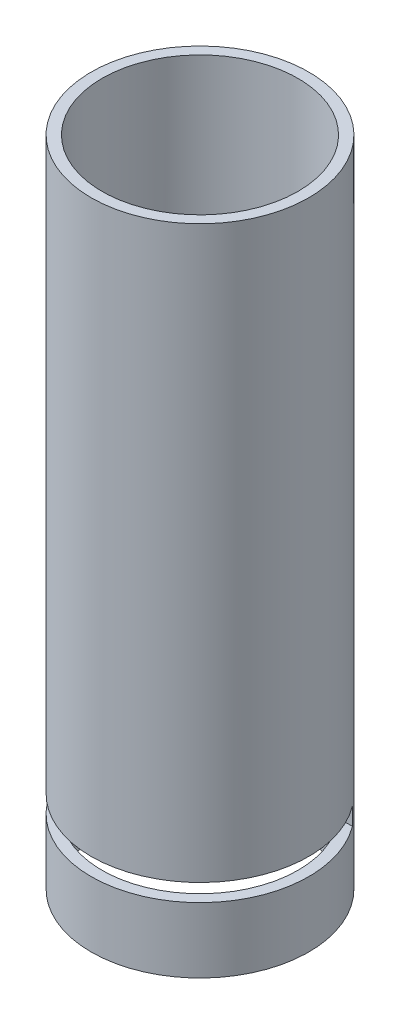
from build123d import *

# Parameters (mm, degrees)
SKIZZE1_R                    = 50
SKIZZE1_R_2                  = 45
LINEAR_AUSTRAGEN_D_NN1_DEPTH = 300
SKIZZE2_W                    = 110
SKIZZE2_H                    = 8
LINEAR_AUSTRAGEN1_DEPTH      = 80


with BuildPart() as part:
    # Skizze1 → Linear-Austragen-D_nn1 (new body)
    with BuildSketch(Plane(origin=(0, 0, 0), x_dir=(1, 0, 0), z_dir=(0, 1, 0))):
        Circle(SKIZZE1_R)
        Circle(SKIZZE1_R_2, mode=Mode.SUBTRACT)
    extrude(amount=LINEAR_AUSTRAGEN_D_NN1_DEPTH)

    # Skizze2 → Linear austragen1 (cut)
    with BuildSketch(Plane.XY.offset(50)):
        with Locations((0, 34)):
            Rectangle(SKIZZE2_W, SKIZZE2_H)
    extrude(amount=-LINEAR_AUSTRAGEN1_DEPTH, mode=Mode.SUBTRACT)


solid = part.part
